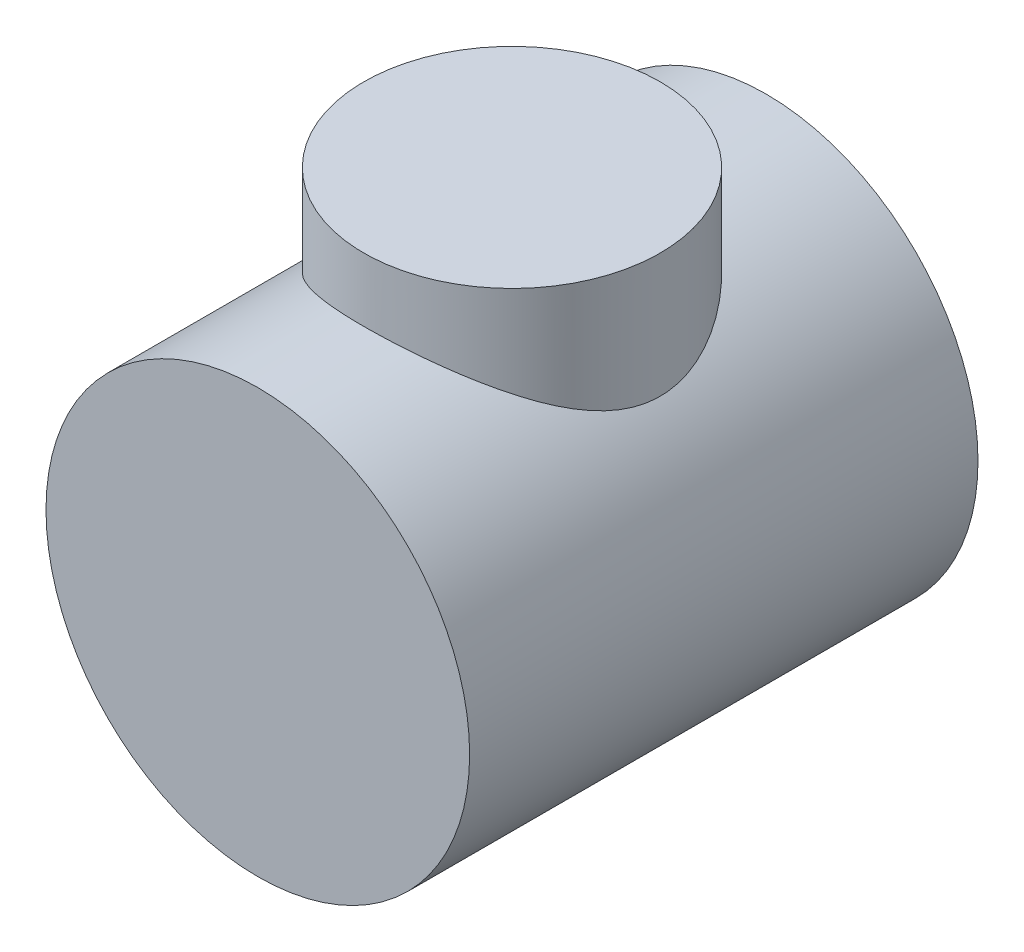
ISO-10303-21;
HEADER;
FILE_DESCRIPTION(('STEP AP214'),'2;1');
FILE_NAME('part.step','',(''),(''),'','','');
FILE_SCHEMA(('AUTOMOTIVE_DESIGN { 1 0 10303 214 1 1 1 1 }'));
ENDSEC;
DATA;
#1=APPLICATION_CONTEXT('core data for automotive mechanical design processes');
#2=APPLICATION_PROTOCOL_DEFINITION('international standard','automotive_design',2000,#1);
#3=PRODUCT_CONTEXT('',#1,'mechanical');
#4=PRODUCT('Part','Part','',(#3));
#5=PRODUCT_RELATED_PRODUCT_CATEGORY('part','',(#4));
#6=PRODUCT_DEFINITION_FORMATION('','',#4);
#7=PRODUCT_DEFINITION_CONTEXT('part definition',#1,'design');
#8=PRODUCT_DEFINITION('design','',#6,#7);
#9=PRODUCT_DEFINITION_SHAPE('','',#8);
#10=(LENGTH_UNIT() NAMED_UNIT(*) SI_UNIT(.MILLI.,.METRE.));
#11=(NAMED_UNIT(*) PLANE_ANGLE_UNIT() SI_UNIT($,.RADIAN.));
#12=(NAMED_UNIT(*) SI_UNIT($,.STERADIAN.) SOLID_ANGLE_UNIT());
#13=UNCERTAINTY_MEASURE_WITH_UNIT(LENGTH_MEASURE(1.E-05),#10,'distance_accuracy_value','');
#14=(GEOMETRIC_REPRESENTATION_CONTEXT(3) GLOBAL_UNCERTAINTY_ASSIGNED_CONTEXT((#13)) GLOBAL_UNIT_ASSIGNED_CONTEXT((#10,
#11,#12)) REPRESENTATION_CONTEXT('',''));
#15=CARTESIAN_POINT('',(0.,0.,0.));
#16=DIRECTION('',(0.,0.,1.));
#17=DIRECTION('',(1.,0.,0.));
#18=AXIS2_PLACEMENT_3D('',#15,#16,#17);
#19=CARTESIAN_POINT('',(0.,0.,60.));
#20=DIRECTION('',(0.,0.,-1.));
#21=DIRECTION('',(-1.,0.,0.));
#22=AXIS2_PLACEMENT_3D('',#19,#20,#21);
#23=CYLINDRICAL_SURFACE('',#22,50.);
#24=CARTESIAN_POINT('',(0.,0.,60.));
#25=DIRECTION('',(0.,0.,1.));
#26=DIRECTION('',(-1.,0.,0.));
#27=AXIS2_PLACEMENT_3D('',#24,#25,#26);
#28=CIRCLE('',#27,50.);
#29=CARTESIAN_POINT('',(-50.,0.,60.));
#30=VERTEX_POINT('',#29);
#31=EDGE_CURVE('E39',#30,#30,#28,.T.);
#32=ORIENTED_EDGE('',*,*,#31,.F.);
#33=EDGE_LOOP('',(#32));
#34=FACE_BOUND('',#33,.T.);
#35=CARTESIAN_POINT('',(0.,0.,-60.));
#36=DIRECTION('',(0.,0.,1.));
#37=DIRECTION('',(-1.,0.,0.));
#38=AXIS2_PLACEMENT_3D('',#35,#36,#37);
#39=CIRCLE('',#38,50.);
#40=CARTESIAN_POINT('',(-50.,0.,-60.));
#41=VERTEX_POINT('',#40);
#42=EDGE_CURVE('E43',#41,#41,#39,.T.);
#43=ORIENTED_EDGE('',*,*,#42,.T.);
#44=EDGE_LOOP('',(#43));
#45=FACE_BOUND('',#44,.T.);
#46=CARTESIAN_POINT('',(0.,50.,-35.));
#47=CARTESIAN_POINT('',(-0.870232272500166,50.0000046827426,-35.0000050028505));
#48=CARTESIAN_POINT('',(-1.7404063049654,49.977236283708,-34.9675030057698));
#49=CARTESIAN_POINT('',(-3.47352174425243,49.8867459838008,-34.83804802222));
#50=CARTESIAN_POINT('',(-4.33646377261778,49.8190279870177,-34.741100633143));
#51=CARTESIAN_POINT('',(-6.04853863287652,49.64026883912,-34.4842684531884));
#52=CARTESIAN_POINT('',(-6.89766808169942,49.5292172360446,-34.3243684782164));
#53=CARTESIAN_POINT('',(-8.57578993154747,49.2663904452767,-33.9440143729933));
#54=CARTESIAN_POINT('',(-9.4047816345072,49.1146138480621,-33.7235581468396));
#55=CARTESIAN_POINT('',(-11.0332645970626,48.7745391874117,-33.2263207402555));
#56=CARTESIAN_POINT('',(-11.8328814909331,48.5864254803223,-32.949823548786));
#57=CARTESIAN_POINT('',(-13.4026192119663,48.1770464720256,-32.3431278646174));
#58=CARTESIAN_POINT('',(-14.1727403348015,47.9557815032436,-32.0129299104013));
#59=CARTESIAN_POINT('',(-15.6801115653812,47.484289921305,-31.3022123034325));
#60=CARTESIAN_POINT('',(-16.4173617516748,47.2340633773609,-30.9216927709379));
#61=CARTESIAN_POINT('',(-17.8564301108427,46.7090427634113,-30.1136018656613));
#62=CARTESIAN_POINT('',(-18.5582465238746,46.434247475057,-29.6860281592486));
#63=CARTESIAN_POINT('',(-19.9848211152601,45.8394551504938,-28.7471572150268));
#64=CARTESIAN_POINT('',(-20.7061360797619,45.5176092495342,-28.2318011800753));
#65=CARTESIAN_POINT('',(-22.102634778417,44.8561100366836,-27.1523945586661));
#66=CARTESIAN_POINT('',(-22.7778163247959,44.5164558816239,-26.5883416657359));
#67=CARTESIAN_POINT('',(-24.0815274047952,43.824938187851,-25.4135997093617));
#68=CARTESIAN_POINT('',(-24.7099908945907,43.4730583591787,-24.8028470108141));
#69=CARTESIAN_POINT('',(-25.917999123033,42.7638631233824,-23.5376807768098));
#70=CARTESIAN_POINT('',(-26.4975410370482,42.4065474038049,-22.883264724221));
#71=CARTESIAN_POINT('',(-27.7041565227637,41.6302860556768,-21.4134589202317));
#72=CARTESIAN_POINT('',(-28.3216161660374,41.2115730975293,-20.5900212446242));
#73=CARTESIAN_POINT('',(-29.4846248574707,40.3876824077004,-18.8870417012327));
#74=CARTESIAN_POINT('',(-30.030155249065,39.9825082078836,-18.0074853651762));
#75=CARTESIAN_POINT('',(-31.0449435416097,39.1997644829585,-16.1953260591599));
#76=CARTESIAN_POINT('',(-31.5142997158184,38.8221597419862,-15.2627935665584));
#77=CARTESIAN_POINT('',(-32.3725792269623,38.1094117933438,-13.3460634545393));
#78=CARTESIAN_POINT('',(-32.7615449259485,37.774246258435,-12.3618933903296));
#79=CARTESIAN_POINT('',(-33.3451470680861,37.2585850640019,-10.6601711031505));
#80=CARTESIAN_POINT('',(-33.5625682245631,37.0624390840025,-9.95511151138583));
#81=CARTESIAN_POINT('',(-33.9540987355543,36.7040823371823,-8.52459851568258));
#82=CARTESIAN_POINT('',(-34.1282150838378,36.5418660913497,-7.79914842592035));
#83=CARTESIAN_POINT('',(-34.4305317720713,36.2571602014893,-6.33231404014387));
#84=CARTESIAN_POINT('',(-34.5588090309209,36.1346040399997,-5.59095867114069));
#85=CARTESIAN_POINT('',(-34.7677456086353,35.9336193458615,-4.09556918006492));
#86=CARTESIAN_POINT('',(-34.8484050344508,35.8551907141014,-3.34153508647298));
#87=CARTESIAN_POINT('',(-34.9608969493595,35.7455170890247,-1.82193032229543));
#88=CARTESIAN_POINT('',(-34.9924426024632,35.7145492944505,-1.05631805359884));
#89=CARTESIAN_POINT('',(-35.0051496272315,35.7020949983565,0.475730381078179));
#90=CARTESIAN_POINT('',(-34.9863111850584,35.7206083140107,1.24216654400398));
#91=CARTESIAN_POINT('',(-34.8986208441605,35.8062836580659,2.76984985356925));
#92=CARTESIAN_POINT('',(-34.8297390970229,35.8734747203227,3.53109362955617));
#93=CARTESIAN_POINT('',(-34.6432842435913,36.0535648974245,5.04206377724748));
#94=CARTESIAN_POINT('',(-34.5257101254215,36.1664649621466,5.79178990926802));
#95=CARTESIAN_POINT('',(-34.2532963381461,36.4245018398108,7.2255354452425));
#96=CARTESIAN_POINT('',(-34.1014533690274,36.5669968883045,7.91060977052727));
#97=CARTESIAN_POINT('',(-33.7589888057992,36.8833971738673,9.26380107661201));
#98=CARTESIAN_POINT('',(-33.5683529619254,37.0573139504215,9.9319117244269));
#99=CARTESIAN_POINT('',(-33.1501750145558,37.4318666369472,11.2491653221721));
#100=CARTESIAN_POINT('',(-32.9226130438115,37.6325169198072,11.8982978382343));
#101=CARTESIAN_POINT('',(-32.4325419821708,38.0556836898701,13.1756669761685));
#102=CARTESIAN_POINT('',(-32.1700382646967,38.2781968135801,13.8039067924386));
#103=CARTESIAN_POINT('',(-31.4634650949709,38.8633221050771,15.3663950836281));
#104=CARTESIAN_POINT('',(-30.996945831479,39.2376405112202,16.2861965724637));
#105=CARTESIAN_POINT('',(-29.990231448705,40.0123702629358,18.0731428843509));
#106=CARTESIAN_POINT('',(-29.4500062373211,40.4127922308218,18.9402659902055));
#107=CARTESIAN_POINT('',(-28.2982946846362,41.2274781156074,20.6215052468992));
#108=CARTESIAN_POINT('',(-27.6866822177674,41.6417655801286,21.4355234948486));
#109=CARTESIAN_POINT('',(-26.395557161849,42.4719157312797,23.0067017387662));
#110=CARTESIAN_POINT('',(-25.716053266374,42.8877782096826,23.7638689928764));
#111=CARTESIAN_POINT('',(-24.282503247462,43.7155961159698,25.227400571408));
#112=CARTESIAN_POINT('',(-23.5276600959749,44.1274446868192,25.9330457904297));
#113=CARTESIAN_POINT('',(-21.9523703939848,44.9318997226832,27.2794229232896));
#114=CARTESIAN_POINT('',(-21.1319177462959,45.3245043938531,27.9201487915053));
#115=CARTESIAN_POINT('',(-19.4296026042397,46.0798886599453,29.1303820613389));
#116=CARTESIAN_POINT('',(-18.5478533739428,46.4427206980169,29.7000156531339));
#117=CARTESIAN_POINT('',(-16.7254223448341,47.1296898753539,30.7631633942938));
#118=CARTESIAN_POINT('',(-15.7847582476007,47.4538385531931,31.2567002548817));
#119=CARTESIAN_POINT('',(-14.0638566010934,47.9878194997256,32.0608786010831));
#120=CARTESIAN_POINT('',(-13.294127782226,48.2070816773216,32.3878323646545));
#121=CARTESIAN_POINT('',(-11.7255644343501,48.6124153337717,32.98811888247));
#122=CARTESIAN_POINT('',(-10.9267338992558,48.7984913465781,33.2614589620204));
#123=CARTESIAN_POINT('',(-9.30461607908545,49.1335896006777,33.7511702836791));
#124=CARTESIAN_POINT('',(-8.48134125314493,49.2826303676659,33.9675700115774));
#125=CARTESIAN_POINT('',(-6.81512211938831,49.5405359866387,34.3406887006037));
#126=CARTESIAN_POINT('',(-5.97217741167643,49.6494000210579,34.4974064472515));
#127=CARTESIAN_POINT('',(-4.26917518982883,49.8247911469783,34.7493603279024));
#128=CARTESIAN_POINT('',(-3.40906158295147,49.8911424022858,34.8443411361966));
#129=CARTESIAN_POINT('',(-1.68186449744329,49.9791858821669,34.9702882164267));
#130=CARTESIAN_POINT('',(-0.814781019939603,50.0008781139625,35.0012544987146));
#131=CARTESIAN_POINT('',(0.919213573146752,49.999067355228,34.9986676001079));
#132=CARTESIAN_POINT('',(1.78612469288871,49.9755656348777,34.9651162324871));
#133=CARTESIAN_POINT('',(3.51268174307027,49.8839489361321,34.8340431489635));
#134=CARTESIAN_POINT('',(4.37232793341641,49.8158355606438,34.736523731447));
#135=CARTESIAN_POINT('',(6.0218146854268,49.6425220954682,34.4874963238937));
#136=CARTESIAN_POINT('',(6.81254374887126,49.5400387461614,34.3399362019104));
#137=CARTESIAN_POINT('',(8.37678839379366,49.2996505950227,33.9922245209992));
#138=CARTESIAN_POINT('',(9.15030488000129,49.1617476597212,33.7920757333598));
#139=CARTESIAN_POINT('',(10.6758813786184,48.8531610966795,33.3415398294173));
#140=CARTESIAN_POINT('',(11.4279395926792,48.6824747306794,33.0911485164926));
#141=CARTESIAN_POINT('',(12.9069400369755,48.3114097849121,32.5427880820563));
#142=CARTESIAN_POINT('',(13.6338808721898,48.1110295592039,32.244816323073));
#143=CARTESIAN_POINT('',(15.1100577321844,47.668867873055,31.5814246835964));
#144=CARTESIAN_POINT('',(15.8572430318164,47.4251620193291,31.2127277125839));
#145=CARTESIAN_POINT('',(17.3166332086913,46.9119671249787,30.4273074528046));
#146=CARTESIAN_POINT('',(18.0288368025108,46.6424771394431,30.0105824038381));
#147=CARTESIAN_POINT('',(19.4164933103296,46.0821002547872,29.1320185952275));
#148=CARTESIAN_POINT('',(20.0919284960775,45.7912031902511,28.6701583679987));
#149=CARTESIAN_POINT('',(21.4041263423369,45.1927373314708,27.7042811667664));
#150=CARTESIAN_POINT('',(22.0408868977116,44.8851676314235,27.2002619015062));
#151=CARTESIAN_POINT('',(23.3800396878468,44.2044129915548,26.0628453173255));
#152=CARTESIAN_POINT('',(24.0750385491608,43.8290006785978,25.4220614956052));
#153=CARTESIAN_POINT('',(25.4087931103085,43.0695056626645,24.0890524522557));
#154=CARTESIAN_POINT('',(26.0475407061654,42.6854217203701,23.3968198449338));
#155=CARTESIAN_POINT('',(27.267628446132,41.916544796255,21.9627738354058));
#156=CARTESIAN_POINT('',(27.8489237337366,41.531751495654,21.2209224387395));
#157=CARTESIAN_POINT('',(28.9516393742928,40.7707152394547,19.6899077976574));
#158=CARTESIAN_POINT('',(29.4730665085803,40.3944713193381,18.9007499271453));
#159=CARTESIAN_POINT('',(30.4067125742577,39.695574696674,17.3541850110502));
#160=CARTESIAN_POINT('',(30.8246071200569,39.3712388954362,16.6009653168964));
#161=CARTESIAN_POINT('',(31.6071001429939,38.7458650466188,15.0578711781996));
#162=CARTESIAN_POINT('',(31.971697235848,38.444827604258,14.2679957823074));
#163=CARTESIAN_POINT('',(32.6439561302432,37.8756633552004,12.6544361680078));
#164=CARTESIAN_POINT('',(32.9517078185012,37.6074848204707,11.8308078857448));
#165=CARTESIAN_POINT('',(33.5072229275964,37.1133993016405,10.1512421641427));
#166=CARTESIAN_POINT('',(33.7550024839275,36.8874809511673,9.29531348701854));
#167=CARTESIAN_POINT('',(34.1428567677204,36.5283500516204,7.7315330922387));
#168=CARTESIAN_POINT('',(34.2945793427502,36.3856289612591,7.02874420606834));
#169=CARTESIAN_POINT('',(34.5552281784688,36.1381878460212,5.60866076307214));
#170=CARTESIAN_POINT('',(34.6641599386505,36.0334629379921,4.89136808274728));
#171=CARTESIAN_POINT('',(34.8373963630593,35.8660062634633,3.44731721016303));
#172=CARTESIAN_POINT('',(34.9017502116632,35.8032282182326,2.72057035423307));
#173=CARTESIAN_POINT('',(34.9848682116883,35.7220160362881,1.26196217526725));
#174=CARTESIAN_POINT('',(35.0036319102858,35.7035823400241,0.5301008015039));
#175=CARTESIAN_POINT('',(34.9952029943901,35.7118439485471,-0.933973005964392));
#176=CARTESIAN_POINT('',(34.9679555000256,35.7385931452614,-1.66618481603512));
#177=CARTESIAN_POINT('',(34.8679201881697,35.8361961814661,-3.12447973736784));
#178=CARTESIAN_POINT('',(34.7951326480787,35.9070497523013,-3.85056288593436));
#179=CARTESIAN_POINT('',(34.6051877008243,36.0901414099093,-5.29249658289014));
#180=CARTESIAN_POINT('',(34.4879747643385,36.2024312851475,-6.00833315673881));
#181=CARTESIAN_POINT('',(34.2110182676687,36.4642622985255,-7.42477357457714));
#182=CARTESIAN_POINT('',(34.0512690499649,36.6138083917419,-8.12537537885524));
#183=CARTESIAN_POINT('',(33.6404354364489,36.9921554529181,-9.7036406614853));
#184=CARTESIAN_POINT('',(33.376297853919,37.2314112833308,-10.5754147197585));
#185=CARTESIAN_POINT('',(32.7858092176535,37.7524242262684,-12.2844975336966));
#186=CARTESIAN_POINT('',(32.4594391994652,38.034194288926,-13.1217956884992));
#187=CARTESIAN_POINT('',(31.7479704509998,38.6300643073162,-14.7602513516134));
#188=CARTESIAN_POINT('',(31.3628028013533,38.9442020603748,-15.5613649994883));
#189=CARTESIAN_POINT('',(30.5371993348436,39.5948947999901,-17.1248665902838));
#190=CARTESIAN_POINT('',(30.0967667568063,39.9314484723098,-17.8872567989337));
#191=CARTESIAN_POINT('',(29.1519412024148,40.6265479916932,-19.3899619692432));
#192=CARTESIAN_POINT('',(28.6462778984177,40.985426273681,-20.1293230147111));
#193=CARTESIAN_POINT('',(27.5815143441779,41.7094065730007,-21.5652255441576));
#194=CARTESIAN_POINT('',(27.0224143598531,42.074508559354,-22.2617672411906));
#195=CARTESIAN_POINT('',(25.8521175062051,42.8035444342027,-23.6107068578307));
#196=CARTESIAN_POINT('',(25.2409057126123,43.167477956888,-24.2630920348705));
#197=CARTESIAN_POINT('',(23.9678165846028,43.8871120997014,-25.5214602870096));
#198=CARTESIAN_POINT('',(23.3059338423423,44.24281183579,-26.1274383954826));
#199=CARTESIAN_POINT('',(21.8062903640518,45.003517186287,-27.397459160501));
#200=CARTESIAN_POINT('',(20.9585928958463,45.4055331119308,-28.0516304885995));
#201=CARTESIAN_POINT('',(19.1968024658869,46.1780037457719,-29.2854798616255));
#202=CARTESIAN_POINT('',(18.2826994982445,46.5484536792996,-29.8651466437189));
#203=CARTESIAN_POINT('',(16.3931041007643,47.2470080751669,-30.9426542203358));
#204=CARTESIAN_POINT('',(15.4176640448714,47.5751479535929,-31.4405635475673));
#205=CARTESIAN_POINT('',(13.4109161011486,48.1792930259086,-32.3474679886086));
#206=CARTESIAN_POINT('',(12.3796240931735,48.4553129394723,-32.7564882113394));
#207=CARTESIAN_POINT('',(10.4286834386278,48.9089902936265,-33.4236386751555));
#208=CARTESIAN_POINT('',(9.51560891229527,49.0952007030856,-33.6952158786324));
#209=CARTESIAN_POINT('',(7.66208842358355,49.4183857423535,-34.1643944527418));
#210=CARTESIAN_POINT('',(6.72164532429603,49.5553655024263,-34.3620035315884));
#211=CARTESIAN_POINT('',(4.82256952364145,49.7760550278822,-34.679513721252));
#212=CARTESIAN_POINT('',(3.86395723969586,49.8598213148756,-34.7994972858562));
#213=CARTESIAN_POINT('',(1.93687202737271,49.971788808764,-34.9597342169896));
#214=CARTESIAN_POINT('',(0.968399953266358,49.9999947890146,-34.9999944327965));
#215=CARTESIAN_POINT('',(0.,50.,-35.));
#216=B_SPLINE_CURVE_WITH_KNOTS('',3,(#46,#47,#48,#49,#50,#51,#52,#53,#54,#55,#56,#57,#58,#59,
#60,#61,#62,#63,#64,#65,#66,#67,#68,#69,#70,#71,#72,#73,#74,#75,#76,#77,#78,#79,#80,#81,#82,#83,
#84,#85,#86,#87,#88,#89,#90,#91,#92,#93,#94,#95,#96,#97,#98,#99,#100,#101,#102,#103,#104,#105,
#106,#107,#108,#109,#110,#111,#112,#113,#114,#115,#116,#117,#118,#119,#120,#121,#122,#123,#124,
#125,#126,#127,#128,#129,#130,#131,#132,#133,#134,#135,#136,#137,#138,#139,#140,#141,#142,#143,
#144,#145,#146,#147,#148,#149,#150,#151,#152,#153,#154,#155,#156,#157,#158,#159,#160,#161,#162,
#163,#164,#165,#166,#167,#168,#169,#170,#171,#172,#173,#174,#175,#176,#177,#178,#179,#180,#181,
#182,#183,#184,#185,#186,#187,#188,#189,#190,#191,#192,#193,#194,#195,#196,#197,#198,#199,#200,
#201,#202,#203,#204,#205,#206,#207,#208,#209,#210,#211,#212,#213,#214,#215),.UNSPECIFIED.,.T.,
.F.,(4,2,2,2,2,2,2,2,2,2,2,2,2,2,2,2,2,2,2,2,2,2,2,2,2,2,2,2,2,2,2,2,2,2,2,2,2,2,2,2,2,2,2,2,2,
2,2,2,2,2,2,2,2,2,2,2,2,2,2,2,2,2,2,2,2,2,2,2,2,2,2,2,2,2,2,2,2,2,2,2,2,2,2,2,4),(0.,
2.60970041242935,5.2191741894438,7.82927775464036,10.4394716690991,13.0367549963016,
15.6340122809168,18.2312633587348,20.8286433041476,23.6552943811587,26.4820794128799,
29.3127874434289,32.1436588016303,35.4732627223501,38.803728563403,42.1298629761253,
45.4542401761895,47.7426149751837,50.030619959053,52.3147673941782,54.5989096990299,
56.8963425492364,59.1937669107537,61.4925627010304,63.7914062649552,65.9374376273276,
68.0842587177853,70.2322387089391,72.3798887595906,75.6667414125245,78.9549400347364,
82.249038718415,85.5427161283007,88.8759385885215,92.2094711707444,95.5369998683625,
98.8635335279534,101.454642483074,104.045397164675,106.634853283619,109.224362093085,
111.82451332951,114.424664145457,117.024741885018,119.624726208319,122.054675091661,
124.484495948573,126.914519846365,129.344678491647,131.946449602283,134.548316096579,
137.151426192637,139.754677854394,142.803032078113,145.851824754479,148.902979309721,
151.953787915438,154.712674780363,157.471633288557,160.226191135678,162.980007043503,
165.176869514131,167.373449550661,169.567602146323,171.76177653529,173.958569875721,
176.155349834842,178.354884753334,180.554712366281,183.375960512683,186.198069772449,
189.023512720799,191.848790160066,194.741148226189,197.63349189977,200.526666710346,
203.420150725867,206.846723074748,210.273812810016,213.698014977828,217.121248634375,
220.028985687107,222.936419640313,225.840760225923,228.744851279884),.UNSPECIFIED.);
#217=CARTESIAN_POINT('',(0.,50.,-35.));
#218=VERTEX_POINT('',#217);
#219=EDGE_CURVE('E10',#218,#218,#216,.T.);
#220=ORIENTED_EDGE('',*,*,#219,.F.);
#221=EDGE_LOOP('',(#220));
#222=FACE_BOUND('',#221,.T.);
#223=ADVANCED_FACE('F29',(#34,#45,#222),#23,.T.);
#224=CARTESIAN_POINT('',(0.,0.,60.));
#225=DIRECTION('',(0.,0.,-1.));
#226=DIRECTION('',(-1.,0.,0.));
#227=AXIS2_PLACEMENT_3D('',#224,#225,#226);
#228=PLANE('',#227);
#229=ORIENTED_EDGE('',*,*,#31,.T.);
#230=EDGE_LOOP('',(#229));
#231=FACE_BOUND('',#230,.T.);
#232=ADVANCED_FACE('F63',(#231),#228,.F.);
#233=CARTESIAN_POINT('',(0.,0.,-60.));
#234=DIRECTION('',(0.,0.,-1.));
#235=DIRECTION('',(-1.,0.,0.));
#236=AXIS2_PLACEMENT_3D('',#233,#234,#235);
#237=PLANE('',#236);
#238=ORIENTED_EDGE('',*,*,#42,.F.);
#239=EDGE_LOOP('',(#238));
#240=FACE_BOUND('',#239,.T.);
#241=ADVANCED_FACE('F61',(#240),#237,.T.);
#242=CARTESIAN_POINT('',(0.,0.,0.));
#243=DIRECTION('',(0.,-1.,0.));
#244=DIRECTION('',(0.,0.,-1.));
#245=AXIS2_PLACEMENT_3D('',#242,#243,#244);
#246=CYLINDRICAL_SURFACE('',#245,35.);
#247=CARTESIAN_POINT('',(0.,65.,0.));
#248=DIRECTION('',(0.,-1.,0.));
#249=DIRECTION('',(0.,0.,-1.));
#250=AXIS2_PLACEMENT_3D('',#247,#248,#249);
#251=CIRCLE('',#250,35.);
#252=CARTESIAN_POINT('',(0.,65.,-35.));
#253=VERTEX_POINT('',#252);
#254=EDGE_CURVE('E48',#253,#253,#251,.T.);
#255=ORIENTED_EDGE('',*,*,#254,.T.);
#256=EDGE_LOOP('',(#255));
#257=FACE_BOUND('',#256,.T.);
#258=ORIENTED_EDGE('',*,*,#219,.T.);
#259=EDGE_LOOP('',(#258));
#260=FACE_BOUND('',#259,.T.);
#261=ADVANCED_FACE('F53',(#257,#260),#246,.T.);
#262=CARTESIAN_POINT('',(-17.4201787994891,65.,0.));
#263=DIRECTION('',(0.,-1.,0.));
#264=DIRECTION('',(0.,0.,-1.));
#265=AXIS2_PLACEMENT_3D('',#262,#263,#264);
#266=PLANE('',#265);
#267=ORIENTED_EDGE('',*,*,#254,.F.);
#268=EDGE_LOOP('',(#267));
#269=FACE_BOUND('',#268,.T.);
#270=ADVANCED_FACE('F55',(#269),#266,.F.);
#271=CLOSED_SHELL('',(#223,#232,#241,#261,#270));
#272=MANIFOLD_SOLID_BREP('B2',#271);
#273=ADVANCED_BREP_SHAPE_REPRESENTATION('',(#18,#272),#14);
#274=SHAPE_DEFINITION_REPRESENTATION(#9,#273);
ENDSEC;
END-ISO-10303-21;
